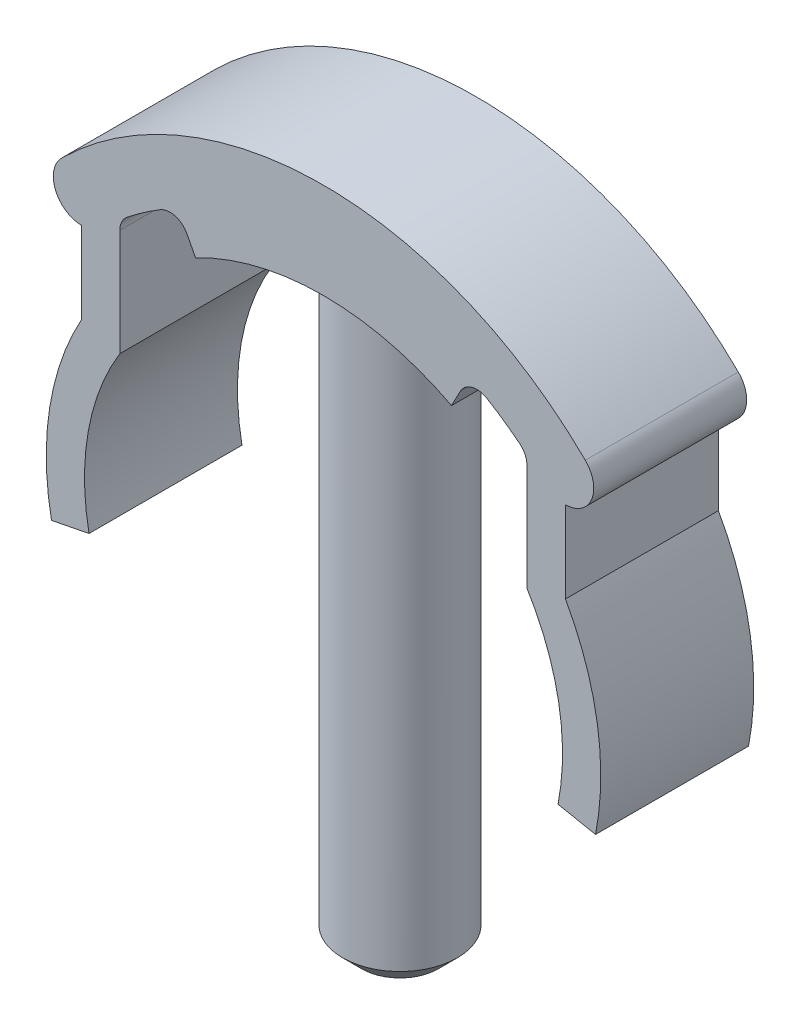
from build123d import *

# Parameters (mm, degrees)
EXTRUDE_1_DEPTH             = 8
EXTRUDE_2_REACH             = 27.583
EXTRUDE_2_END_RADIUS        = 14.5
SKETCH_2_R                  = 3
EXTRUDE_2_DIRECTION_2_DEPTH = 17
CHAMFER_1_SIZE              = 1


with BuildPart() as part:
    # Sketch 1 → Extrude 1 (new body)
    with BuildSketch(Plane.XY):
        with BuildLine():
            ThreePointArc((-7.140400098, 13.720957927), (-7.757577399, 14.222215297), (-8.545372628, 14.114765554))
            ThreePointArc((-8.545372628, 14.114765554), (-9.430149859, 13.539655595), (-10.276355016, 12.909164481))
            ThreePointArc((-10.276355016, 12.909164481), (-10.55432567, 12.561066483), (-10.653545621, 12.126790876))
            Line((-10.653545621, 12.126790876), (-10.653545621, 6.538498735))
            ThreePointArc((-10.653545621, 6.538498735), (-12.302222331, 2.21479699), (-12.265, -2.412420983))
            Line((-12.265, -2.412420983), (-14.2274, -2.79840834))
            ThreePointArc((-14.2274, -2.79840834), (-14.319427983, 2.281223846), (-12.653545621, 7.080803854))
            Line((-12.653545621, 7.080803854), (-12.653545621, 11.352875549))
            ThreePointArc((-12.653545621, 11.352875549), (-14.021740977, 12.270536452), (-13.69187604, 13.884614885))
            ThreePointArc((-13.69187604, 13.884614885), (0, 19.5), (13.69187604, 13.884614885))
            ThreePointArc((13.69187604, 13.884614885), (14.021740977, 12.270536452), (12.653545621, 11.352875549))
            Line((12.653545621, 11.352875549), (12.653545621, 7.080803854))
            ThreePointArc((12.653545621, 7.080803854), (14.319427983, 2.281223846), (14.2274, -2.79840834))
            Line((14.2274, -2.79840834), (12.265, -2.412420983))
            ThreePointArc((12.265, -2.412420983), (12.299323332, 2.230839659), (10.636454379, 6.566265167))
            Line((10.636454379, 6.566265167), (10.636454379, 12.140376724))
            ThreePointArc((10.636454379, 12.140376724), (10.536928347, 12.575286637), (10.258161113, 12.923626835))
            ThreePointArc((10.258161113, 12.923626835), (9.420611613, 13.546293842), (8.545372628, 14.114765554))
            ThreePointArc((8.545372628, 14.114765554), (7.757577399, 14.222215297), (7.140400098, 13.720957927))
            Line((7.140400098, 13.720957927), (6.693674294, 12.862531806))
            ThreePointArc((6.693674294, 12.862531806), (0, 14.5), (-6.693674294, 12.862531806))
            Line((-6.693674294, 12.862531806), (-7.140400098, 13.720957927))
        make_face()
    extrude(amount=EXTRUDE_1_DEPTH)

    # Extrude 2: up to this cylinder (the profile starts inside it)
    extrude_2_end = Plane(origin=(0, 0, 4), z_dir=(0, 0, -1)) * Cylinder(EXTRUDE_2_END_RADIUS, 85.166, mode=Mode.PRIVATE)
    # Sketch 2 → Extrude 2 (add, up to the surface)
    with BuildSketch(Plane(origin=(0, 0, 0), x_dir=(1, 0, 0), z_dir=(0, 1, 0)), mode=Mode.PRIVATE) as extrude_2_sk1:
        with Locations(Location((0, -4, 0), (0, 0, 90))):
            Circle(SKETCH_2_R)
    extrude_2_tool1 = extrude(extrude_2_sk1.sketch, amount=EXTRUDE_2_REACH, mode=Mode.PRIVATE) & extrude_2_end
    add(extrude_2_tool1.solids().sort_by_distance((0, 0, 4))[0])

    # Sketch 2 → Extrude 2 direction 2 (add)
    with BuildSketch(Plane(origin=(0, 0, 0), x_dir=(1, 0, 0), z_dir=(0, 1, 0))):
        with Locations(Location((0, -4, 0), (0, 0, 90))):
            Circle(SKETCH_2_R)
    extrude(amount=-EXTRUDE_2_DIRECTION_2_DEPTH)

    # Chamfer 1
    chamfer_1_edges = [part.edges().sort_by_distance(p)[0] for p in [
        (0, -17, 7),
    ]]
    chamfer(chamfer_1_edges, length=CHAMFER_1_SIZE)


solid = part.part
